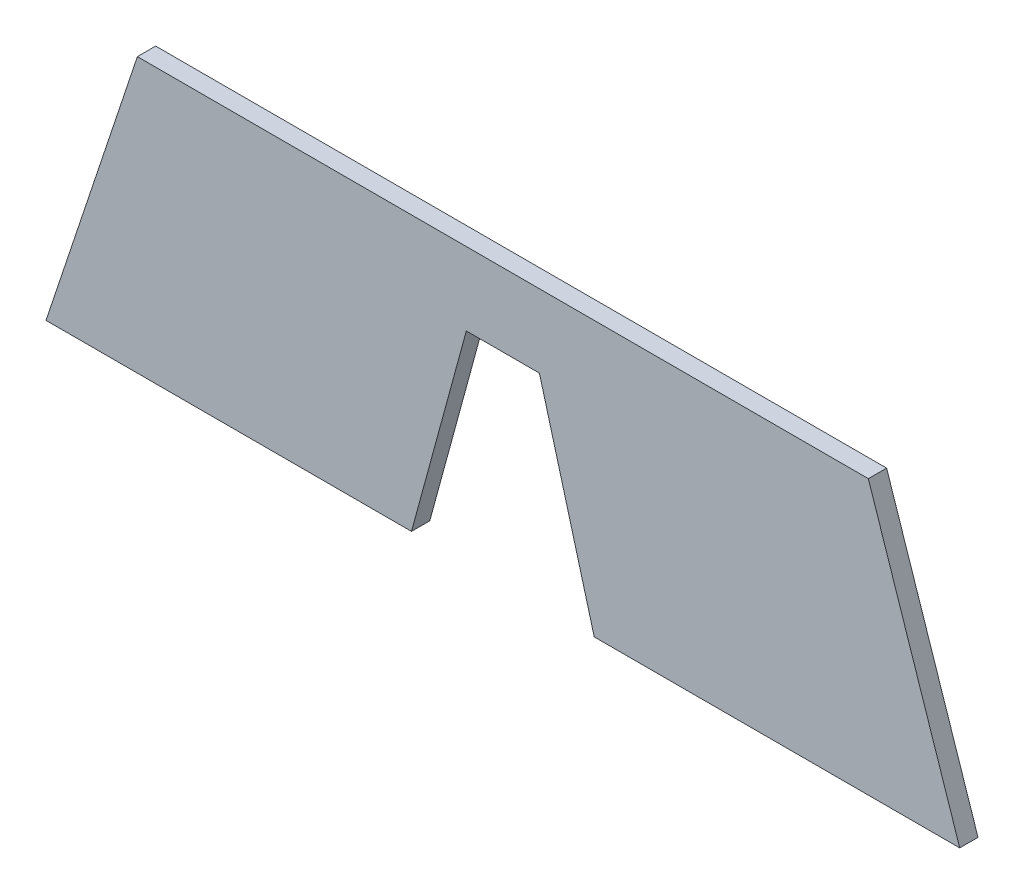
from build123d import *

# Parameters (mm, degrees)
BOSS_EXTRUDE1_DEPTH = 2


with BuildPart() as part:
    # Sketch1 → Boss-Extrude1 (new body)
    with BuildSketch(Plane.XY):
        Polygon((51.12802539, 0), (-28.87197461, 0), (-38.87197461, -30), (1.12802539, -30), (7.12802539, -8), (15.12802539, -8), (21.12802539, -30), (61.12802539, -30), align=None)
    extrude(amount=BOSS_EXTRUDE1_DEPTH)


solid = part.part
